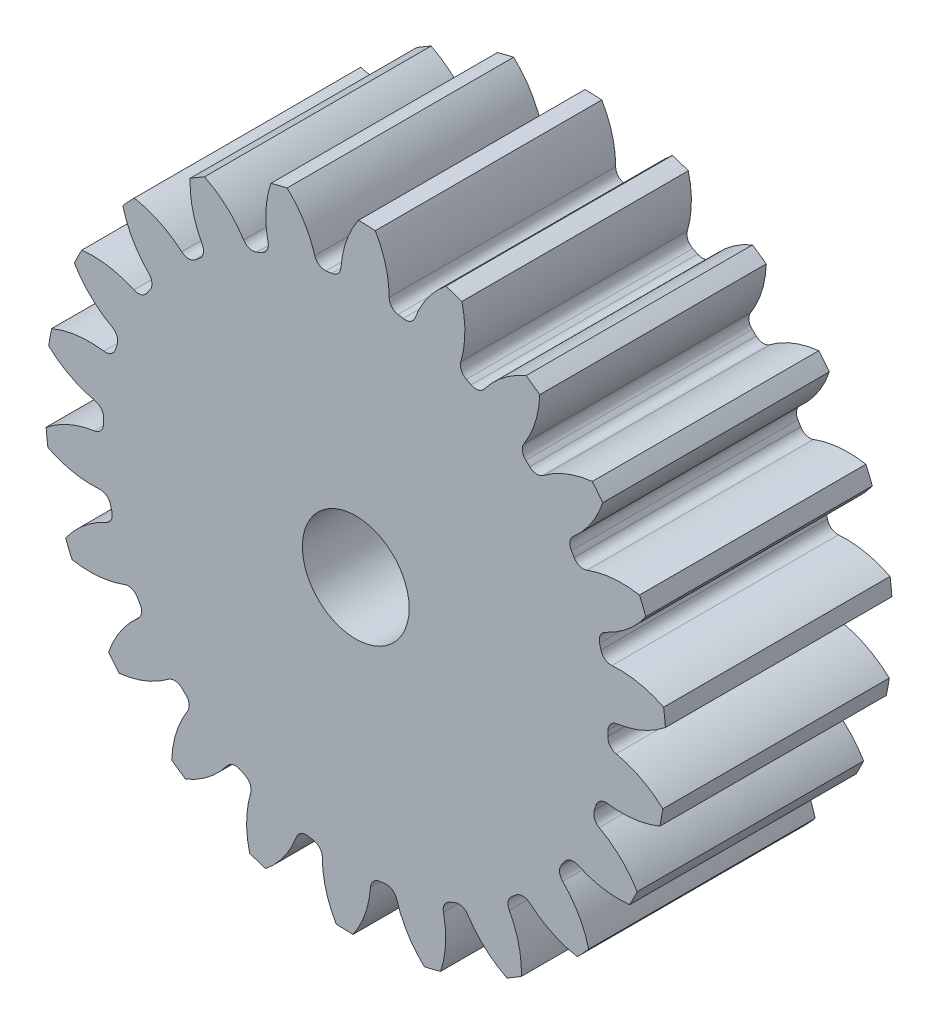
from build123d import *

# Parameters (mm, degrees)
SKETCH3_R         = 121.92
GEARBODY_DEPTH    = 88.9
TOOTHCUT_DEPTH    = 194.990161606
CIRPATTERN1_COUNT = 22
BOREDIA_R         = 20.955
BORE_DEPTH        = 12700


with BuildPart() as part:
    # Sketch3 → gearBody (new body)
    with BuildSketch(Plane.XY):
        Circle(SKETCH3_R)
    extrude(amount=GEARBODY_DEPTH)

    # Sketch2 → toothCut (cut, through all)
    with BuildSketch(Plane.XY):
        with BuildLine():
            ThreePointArc((98.95291864, -4.604725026), (98.996330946, -3.551064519), (99.028524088, -2.497001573))
            ThreePointArc((99.028524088, -2.497001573), (100.07209575, 0.146430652), (102.575332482, 1.49200919))
            ThreePointArc((102.575332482, 1.49200919), (112.83725263, 4.436288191), (121.92, 10.046946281))
            ThreePointArc((121.92, 10.046946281), (122.254636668, -4.385355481), (120.886797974, -18.756588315))
            ThreePointArc((120.886797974, -18.756588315), (112.229393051, -12.509579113), (102.204802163, -8.837609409))
            ThreePointArc((102.204802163, -8.837609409), (99.804408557, -7.316134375), (98.95291864, -4.604725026))
        make_face()
    toothcut = extrude(amount=TOOTHCUT_DEPTH, mode=Mode.SUBTRACT)

    # CirPattern1: toothCut ×22 about axis
    cirpattern1_axis = Axis((0, 0, 0), (0, 0, 1))
    for i in range(1, CIRPATTERN1_COUNT):
        add(toothcut.rotate(cirpattern1_axis, i * 360 / CIRPATTERN1_COUNT), mode=Mode.SUBTRACT)

    # boreDia → bore (cut, symmetric)
    with BuildSketch(Plane.XY):
        Circle(BOREDIA_R)
    extrude(amount=BORE_DEPTH, both=True, mode=Mode.SUBTRACT)


solid = part.part
